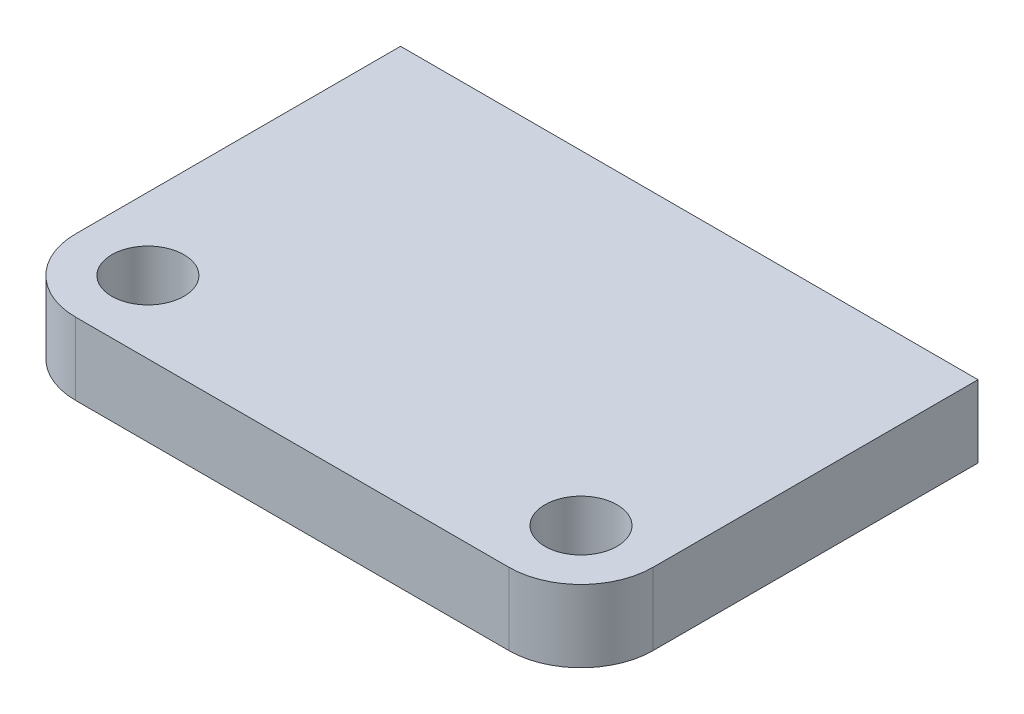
from build123d import *

# Parameters (mm, degrees)
SKETCH_1_R      = 5
EXTRUDE_1_DEPTH = 10


with BuildPart() as part:
    # Sketch 1 → Extrude 1 (new body)
    with BuildSketch(Plane(origin=(0, 0, 0), x_dir=(1, 0, 0), z_dir=(0, 1, 0))):
        with BuildLine():
            Line((40, -4.603646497), (-40, -4.603646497))
            Line((-40, -4.603646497), (-40, -49.603646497))
            ThreePointArc((-40, -49.603646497), (-37.071067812, -56.674714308), (-30, -59.603646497))
            Line((-30, -59.603646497), (30, -59.603646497))
            ThreePointArc((30, -59.603646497), (37.071067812, -56.674714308), (40, -49.603646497))
            Line((40, -49.603646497), (40, -4.603646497))
        make_face()
        with Locations(Location((-30, -49.603646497, 0), (0, 0, 270))):
            Circle(SKETCH_1_R, mode=Mode.SUBTRACT)
        with Locations(Location((30, -49.603646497, 0), (0, 0, 90))):
            Circle(SKETCH_1_R, mode=Mode.SUBTRACT)
    extrude(amount=EXTRUDE_1_DEPTH)


solid = part.part
